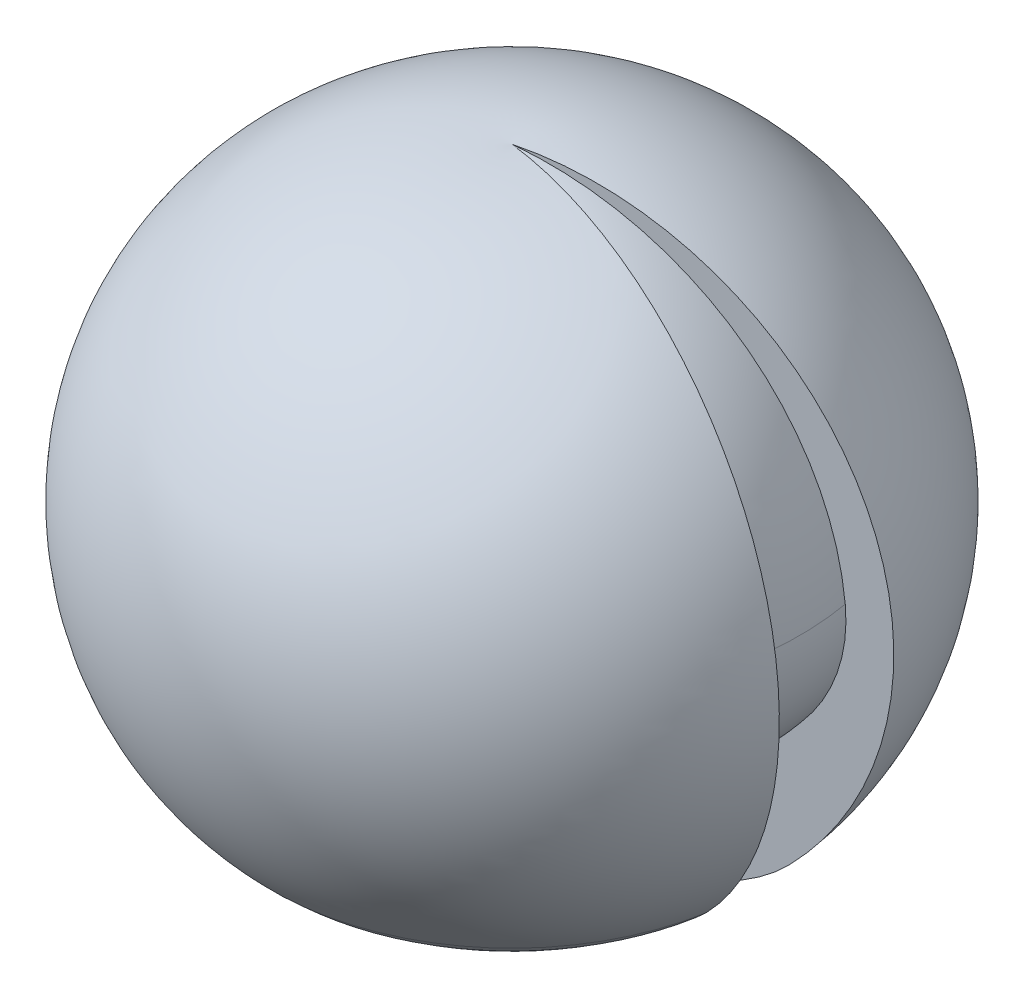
ISO-10303-21;
HEADER;
FILE_DESCRIPTION(('STEP AP214'),'2;1');
FILE_NAME('part.step','',(''),(''),'','','');
FILE_SCHEMA(('AUTOMOTIVE_DESIGN { 1 0 10303 214 1 1 1 1 }'));
ENDSEC;
DATA;
#1=APPLICATION_CONTEXT('core data for automotive mechanical design processes');
#2=APPLICATION_PROTOCOL_DEFINITION('international standard','automotive_design',2000,#1);
#3=PRODUCT_CONTEXT('',#1,'mechanical');
#4=PRODUCT('Part','Part','',(#3));
#5=PRODUCT_RELATED_PRODUCT_CATEGORY('part','',(#4));
#6=PRODUCT_DEFINITION_FORMATION('','',#4);
#7=PRODUCT_DEFINITION_CONTEXT('part definition',#1,'design');
#8=PRODUCT_DEFINITION('design','',#6,#7);
#9=PRODUCT_DEFINITION_SHAPE('','',#8);
#10=(LENGTH_UNIT() NAMED_UNIT(*) SI_UNIT(.MILLI.,.METRE.));
#11=(NAMED_UNIT(*) PLANE_ANGLE_UNIT() SI_UNIT($,.RADIAN.));
#12=(NAMED_UNIT(*) SI_UNIT($,.STERADIAN.) SOLID_ANGLE_UNIT());
#13=UNCERTAINTY_MEASURE_WITH_UNIT(LENGTH_MEASURE(1.E-05),#10,'distance_accuracy_value','');
#14=(GEOMETRIC_REPRESENTATION_CONTEXT(3) GLOBAL_UNCERTAINTY_ASSIGNED_CONTEXT((#13)) GLOBAL_UNIT_ASSIGNED_CONTEXT((#10,
#11,#12)) REPRESENTATION_CONTEXT('',''));
#15=CARTESIAN_POINT('',(0.,0.,0.));
#16=DIRECTION('',(0.,0.,1.));
#17=DIRECTION('',(1.,0.,0.));
#18=AXIS2_PLACEMENT_3D('',#15,#16,#17);
#19=CARTESIAN_POINT('',(0.,365.,-49.9999999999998));
#20=DIRECTION('',(-1.,0.,0.));
#21=DIRECTION('',(0.,0.,-1.));
#22=AXIS2_PLACEMENT_3D('',#19,#20,#21);
#23=CIRCLE('',#22,759.17);
#24=TRIMMED_CURVE('',#23,(PARAMETER_VALUE(-1.63670543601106)),
(PARAMETER_VALUE(1.63670543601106)),.T.,.PARAMETER.);
#25=CARTESIAN_POINT('',(0.,365.,0.));
#26=DIRECTION('',(0.,-1.,0.));
#27=AXIS1_PLACEMENT('',#25,#26);
#28=SURFACE_OF_REVOLUTION('',#24,#27);
#29=CARTESIAN_POINT('',(0.,-171.814255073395,0.));
#30=DIRECTION('',(0.,-1.,0.));
#31=DIRECTION('',(0.,0.,-1.));
#32=AXIS2_PLACEMENT_3D('',#29,#30,#31);
#33=CIRCLE('',#32,586.814255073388);
#34=CARTESIAN_POINT('',(577.899227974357,-171.814255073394,101.899226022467));
#35=VERTEX_POINT('',#34);
#36=CARTESIAN_POINT('',(577.899227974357,-171.814255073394,-101.899226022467));
#37=VERTEX_POINT('',#36);
#38=EDGE_CURVE('E130',#35,#37,#33,.T.);
#39=ORIENTED_EDGE('',*,*,#38,.F.);
#40=CARTESIAN_POINT('',(49.2403876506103,365.,8.68240888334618));
#41=DIRECTION('',(0.173648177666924,0.,-0.984807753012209));
#42=DIRECTION('',(-0.984807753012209,0.,-0.173648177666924));
#43=AXIS2_PLACEMENT_3D('',#40,#41,#42);
#44=CIRCLE('',#43,759.17);
#45=CARTESIAN_POINT('',(0.,1122.52167553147,0.));
#46=VERTEX_POINT('',#45);
#47=EDGE_CURVE('E115',#46,#35,#44,.T.);
#48=ORIENTED_EDGE('',*,*,#47,.F.);
#49=CARTESIAN_POINT('',(49.2403876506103,365.,-8.68240888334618));
#50=DIRECTION('',(-0.173648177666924,0.,-0.984807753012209));
#51=DIRECTION('',(-0.984807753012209,0.,0.173648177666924));
#52=AXIS2_PLACEMENT_3D('',#49,#50,#51);
#53=CIRCLE('',#52,759.17);
#54=EDGE_CURVE('E123',#46,#37,#53,.T.);
#55=ORIENTED_EDGE('',*,*,#54,.T.);
#56=EDGE_LOOP('',(#39,#48,#55));
#57=FACE_BOUND('',#56,.T.);
#58=ADVANCED_FACE('F36',(#57),#28,.T.);
#59=CARTESIAN_POINT('',(0.,103.370490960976,0.));
#60=DIRECTION('',(0.,-1.,0.));
#61=DIRECTION('',(0.,0.,-1.));
#62=AXIS2_PLACEMENT_3D('',#59,#60,#61);
#63=DEGENERATE_TOROIDAL_SURFACE('',#62,311.629509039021,389.17,.T.);
#64=CARTESIAN_POINT('',(0.,-262.862988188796,0.));
#65=DIRECTION('',(0.,-1.,0.));
#66=DIRECTION('',(0.,0.,-1.));
#67=AXIS2_PLACEMENT_3D('',#64,#65,#66);
#68=CIRCLE('',#67,180.);
#69=CARTESIAN_POINT('',(177.265395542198,-262.862988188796,31.2566719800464));
#70=VERTEX_POINT('',#69);
#71=CARTESIAN_POINT('',(177.265395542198,-262.862988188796,-31.2566719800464));
#72=VERTEX_POINT('',#71);
#73=EDGE_CURVE('E151',#70,#72,#68,.T.);
#74=ORIENTED_EDGE('',*,*,#73,.F.);
#75=CARTESIAN_POINT('',(306.895156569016,103.370490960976,54.1138963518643));
#76=DIRECTION('',(0.173648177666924,0.,-0.984807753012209));
#77=DIRECTION('',(-0.984807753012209,0.,-0.173648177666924));
#78=AXIS2_PLACEMENT_3D('',#75,#76,#77);
#79=CIRCLE('',#78,389.17);
#80=EDGE_CURVE('E131',#35,#70,#79,.T.);
#81=ORIENTED_EDGE('',*,*,#80,.F.);
#82=ORIENTED_EDGE('',*,*,#38,.T.);
#83=CARTESIAN_POINT('',(306.895156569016,103.370490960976,-54.1138963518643));
#84=DIRECTION('',(-0.173648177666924,0.,-0.984807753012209));
#85=DIRECTION('',(-0.984807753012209,0.,0.173648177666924));
#86=AXIS2_PLACEMENT_3D('',#83,#84,#85);
#87=CIRCLE('',#86,389.17);
#88=EDGE_CURVE('E127',#37,#72,#87,.T.);
#89=ORIENTED_EDGE('',*,*,#88,.T.);
#90=EDGE_LOOP('',(#74,#81,#82,#89));
#91=FACE_BOUND('',#90,.T.);
#92=ADVANCED_FACE('F38',(#91),#63,.T.);
#93=CARTESIAN_POINT('',(0.,620.747964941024,0.));
#94=DIRECTION('',(0.,-1.,0.));
#95=DIRECTION('',(0.,0.,-1.));
#96=AXIS2_PLACEMENT_3D('',#93,#94,#95);
#97=CYLINDRICAL_SURFACE('',#96,180.);
#98=CARTESIAN_POINT('',(0.,196.924077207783,0.));
#99=DIRECTION('',(0.,-1.,0.));
#100=DIRECTION('',(0.,0.,-1.));
#101=AXIS2_PLACEMENT_3D('',#98,#99,#100);
#102=CIRCLE('',#101,180.);
#103=CARTESIAN_POINT('',(177.265395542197,196.924077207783,31.2566719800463));
#104=VERTEX_POINT('',#103);
#105=CARTESIAN_POINT('',(177.265395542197,196.924077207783,-31.2566719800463));
#106=VERTEX_POINT('',#105);
#107=EDGE_CURVE('E149',#104,#106,#102,.T.);
#108=ORIENTED_EDGE('',*,*,#107,.F.);
#109=DIRECTION('',(0.,1.,0.));
#110=VECTOR('',#109,1.);
#111=CARTESIAN_POINT('',(177.265395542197,196.924077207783,31.2566719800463));
#112=LINE('',#111,#110);
#113=EDGE_CURVE('E134',#70,#104,#112,.T.);
#114=ORIENTED_EDGE('',*,*,#113,.F.);
#115=ORIENTED_EDGE('',*,*,#73,.T.);
#116=DIRECTION('',(0.,1.,0.));
#117=VECTOR('',#116,1.);
#118=CARTESIAN_POINT('',(177.265395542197,196.924077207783,-31.2566719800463));
#119=LINE('',#118,#117);
#120=EDGE_CURVE('E173',#72,#106,#119,.T.);
#121=ORIENTED_EDGE('',*,*,#120,.T.);
#122=EDGE_LOOP('',(#108,#114,#115,#121));
#123=FACE_BOUND('',#122,.T.);
#124=ADVANCED_FACE('F184',(#123),#97,.F.);
#125=CARTESIAN_POINT('',(0.,365.,0.));
#126=DIRECTION('',(0.,-1.,0.));
#127=DIRECTION('',(0.,0.,-1.));
#128=AXIS2_PLACEMENT_3D('',#125,#126,#127);
#129=DEGENERATE_TOROIDAL_SURFACE('',#128,49.9999999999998,212.484154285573,.T.);
#130=CARTESIAN_POINT('',(0.,576.233107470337,0.));
#131=DIRECTION('',(0.,-1.,0.));
#132=DIRECTION('',(0.,0.,-1.));
#133=AXIS2_PLACEMENT_3D('',#130,#131,#132);
#134=CIRCLE('',#133,26.976313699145);
#135=CARTESIAN_POINT('',(26.5664828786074,576.233107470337,4.68438771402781));
#136=VERTEX_POINT('',#135);
#137=CARTESIAN_POINT('',(26.5664828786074,576.233107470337,-4.68438771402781));
#138=VERTEX_POINT('',#137);
#139=EDGE_CURVE('E59',#136,#138,#134,.T.);
#140=ORIENTED_EDGE('',*,*,#139,.F.);
#141=CARTESIAN_POINT('',(49.2403876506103,365.,8.68240888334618));
#142=DIRECTION('',(-0.173648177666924,0.,0.984807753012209));
#143=DIRECTION('',(-0.984807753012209,0.,-0.173648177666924));
#144=AXIS2_PLACEMENT_3D('',#141,#142,#143);
#145=CIRCLE('',#144,212.484154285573);
#146=EDGE_CURVE('E143',#104,#136,#145,.T.);
#147=ORIENTED_EDGE('',*,*,#146,.F.);
#148=ORIENTED_EDGE('',*,*,#107,.T.);
#149=CARTESIAN_POINT('',(49.2403876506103,365.,-8.68240888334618));
#150=DIRECTION('',(0.173648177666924,0.,0.984807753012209));
#151=DIRECTION('',(-0.984807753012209,0.,0.173648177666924));
#152=AXIS2_PLACEMENT_3D('',#149,#150,#151);
#153=CIRCLE('',#152,212.484154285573);
#154=EDGE_CURVE('E137',#106,#138,#153,.T.);
#155=ORIENTED_EDGE('',*,*,#154,.T.);
#156=EDGE_LOOP('',(#140,#147,#148,#155));
#157=FACE_BOUND('',#156,.T.);
#158=ADVANCED_FACE('F177',(#157),#129,.F.);
#159=CARTESIAN_POINT('',(0.,397.247624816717,318.592038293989));
#160=DIRECTION('',(-1.,0.,0.));
#161=DIRECTION('',(0.,0.,-1.));
#162=AXIS2_PLACEMENT_3D('',#159,#160,#161);
#163=CIRCLE('',#162,389.169999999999);
#164=TRIMMED_CURVE('',#163,(PARAMETER_VALUE(-0.611748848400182)),
(PARAMETER_VALUE(0.611748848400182)),.T.,.PARAMETER.);
#165=CARTESIAN_POINT('',(0.,397.247624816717,0.));
#166=DIRECTION('',(0.,-1.,0.));
#167=AXIS1_PLACEMENT('',#165,#166);
#168=SURFACE_OF_REVOLUTION('',#164,#167);
#169=CARTESIAN_POINT('',(-313.751909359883,397.247624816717,55.322926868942));
#170=DIRECTION('',(0.173648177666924,0.,0.984807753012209));
#171=DIRECTION('',(-0.984807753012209,0.,0.173648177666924));
#172=AXIS2_PLACEMENT_3D('',#169,#170,#171);
#173=CIRCLE('',#172,389.169999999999);
#174=CARTESIAN_POINT('',(1.45416380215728E-11,620.747964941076,2.56408312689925E-12));
#175=VERTEX_POINT('',#174);
#176=EDGE_CURVE('E132',#138,#175,#173,.T.);
#177=ORIENTED_EDGE('',*,*,#176,.T.);
#178=CARTESIAN_POINT('',(-313.751909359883,397.247624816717,-55.322926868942));
#179=DIRECTION('',(-0.173648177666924,0.,0.984807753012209));
#180=DIRECTION('',(-0.984807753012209,0.,-0.173648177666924));
#181=AXIS2_PLACEMENT_3D('',#178,#179,#180);
#182=CIRCLE('',#181,389.169999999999);
#183=EDGE_CURVE('E145',#136,#175,#182,.T.);
#184=ORIENTED_EDGE('',*,*,#183,.F.);
#185=ORIENTED_EDGE('',*,*,#139,.T.);
#186=EDGE_LOOP('',(#177,#184,#185));
#187=FACE_BOUND('',#186,.T.);
#188=ADVANCED_FACE('F180',(#187),#168,.F.);
#189=CARTESIAN_POINT('',(49.2403876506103,365.,8.68240888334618));
#190=DIRECTION('',(0.173648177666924,0.,-0.984807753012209));
#191=DIRECTION('',(-0.984807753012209,0.,-0.173648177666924));
#192=AXIS2_PLACEMENT_3D('',#189,#190,#191);
#193=PLANE('',#192);
#194=CARTESIAN_POINT('',(-49.2403876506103,365.,-8.68240888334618));
#195=DIRECTION('',(0.173648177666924,0.,-0.984807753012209));
#196=DIRECTION('',(-0.984807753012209,0.,-0.173648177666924));
#197=AXIS2_PLACEMENT_3D('',#194,#195,#196);
#198=CIRCLE('',#197,759.17);
#199=CARTESIAN_POINT('',(695.551131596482,431.166025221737,122.644430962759));
#200=VERTEX_POINT('',#199);
#201=EDGE_CURVE('E103',#46,#200,#198,.T.);
#202=ORIENTED_EDGE('',*,*,#201,.F.);
#203=ORIENTED_EDGE('',*,*,#47,.T.);
#204=ORIENTED_EDGE('',*,*,#80,.T.);
#205=ORIENTED_EDGE('',*,*,#113,.T.);
#206=ORIENTED_EDGE('',*,*,#146,.T.);
#207=ORIENTED_EDGE('',*,*,#183,.T.);
#208=CARTESIAN_POINT('',(313.751909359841,397.247624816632,55.3229268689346));
#209=DIRECTION('',(0.173648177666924,0.,-0.984807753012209));
#210=DIRECTION('',(-0.984807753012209,0.,-0.173648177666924));
#211=AXIS2_PLACEMENT_3D('',#208,#209,#210);
#212=CIRCLE('',#211,389.170000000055);
#213=CARTESIAN_POINT('',(231.572627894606,777.365872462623,40.8325022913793));
#214=VERTEX_POINT('',#213);
#215=EDGE_CURVE('E119',#214,#175,#212,.F.);
#216=ORIENTED_EDGE('',*,*,#215,.F.);
#217=CARTESIAN_POINT('',(-49.2403876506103,365.,-8.68240888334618));
#218=DIRECTION('',(0.173648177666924,0.,-0.984807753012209));
#219=DIRECTION('',(-0.984807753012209,0.,-0.173648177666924));
#220=AXIS2_PLACEMENT_3D('',#217,#218,#219);
#221=CIRCLE('',#220,501.351462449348);
#222=CARTESIAN_POINT('',(297.825164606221,8.41380289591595,52.5146120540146));
#223=VERTEX_POINT('',#222);
#224=EDGE_CURVE('E168',#223,#214,#221,.F.);
#225=ORIENTED_EDGE('',*,*,#224,.F.);
#226=CARTESIAN_POINT('',(313.751909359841,397.247624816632,55.3229268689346));
#227=DIRECTION('',(0.173648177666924,0.,-0.984807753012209));
#228=DIRECTION('',(-0.984807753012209,0.,-0.173648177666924));
#229=AXIS2_PLACEMENT_3D('',#226,#227,#228);
#230=CIRCLE('',#229,389.17);
#231=EDGE_CURVE('E118',#200,#223,#230,.T.);
#232=ORIENTED_EDGE('',*,*,#231,.F.);
#233=EDGE_LOOP('',(#202,#203,#204,#205,#206,#207,#216,#225,#232));
#234=FACE_BOUND('',#233,.T.);
#235=ADVANCED_FACE('F112',(#234),#193,.T.);
#236=CARTESIAN_POINT('',(49.2403876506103,365.,-8.68240888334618));
#237=DIRECTION('',(-0.173648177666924,0.,-0.984807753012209));
#238=DIRECTION('',(-0.984807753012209,0.,0.173648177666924));
#239=AXIS2_PLACEMENT_3D('',#236,#237,#238);
#240=PLANE('',#239);
#241=ORIENTED_EDGE('',*,*,#54,.F.);
#242=CARTESIAN_POINT('',(-49.2403876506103,365.,8.68240888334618));
#243=DIRECTION('',(-0.173648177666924,0.,-0.984807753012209));
#244=DIRECTION('',(-0.984807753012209,0.,0.173648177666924));
#245=AXIS2_PLACEMENT_3D('',#242,#243,#244);
#246=CIRCLE('',#245,759.17);
#247=CARTESIAN_POINT('',(695.551131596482,431.166025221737,-122.644430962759));
#248=VERTEX_POINT('',#247);
#249=EDGE_CURVE('E11',#46,#248,#246,.T.);
#250=ORIENTED_EDGE('',*,*,#249,.T.);
#251=CARTESIAN_POINT('',(313.751909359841,397.247624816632,-55.3229268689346));
#252=DIRECTION('',(-0.173648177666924,0.,-0.984807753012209));
#253=DIRECTION('',(-0.984807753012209,0.,0.173648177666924));
#254=AXIS2_PLACEMENT_3D('',#251,#252,#253);
#255=CIRCLE('',#254,389.17);
#256=CARTESIAN_POINT('',(297.825164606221,8.41380289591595,-52.5146120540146));
#257=VERTEX_POINT('',#256);
#258=EDGE_CURVE('E44',#248,#257,#255,.T.);
#259=ORIENTED_EDGE('',*,*,#258,.T.);
#260=CARTESIAN_POINT('',(-49.2403876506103,365.,8.68240888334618));
#261=DIRECTION('',(-0.173648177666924,0.,-0.984807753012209));
#262=DIRECTION('',(-0.984807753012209,0.,0.173648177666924));
#263=AXIS2_PLACEMENT_3D('',#260,#261,#262);
#264=CIRCLE('',#263,501.351462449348);
#265=CARTESIAN_POINT('',(231.572627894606,777.365872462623,-40.8325022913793));
#266=VERTEX_POINT('',#265);
#267=EDGE_CURVE('E154',#257,#266,#264,.F.);
#268=ORIENTED_EDGE('',*,*,#267,.T.);
#269=CARTESIAN_POINT('',(313.751909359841,397.247624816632,-55.3229268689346));
#270=DIRECTION('',(-0.173648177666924,0.,-0.984807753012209));
#271=DIRECTION('',(-0.984807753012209,0.,0.173648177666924));
#272=AXIS2_PLACEMENT_3D('',#269,#270,#271);
#273=CIRCLE('',#272,389.170000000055);
#274=EDGE_CURVE('E157',#266,#175,#273,.F.);
#275=ORIENTED_EDGE('',*,*,#274,.T.);
#276=ORIENTED_EDGE('',*,*,#176,.F.);
#277=ORIENTED_EDGE('',*,*,#154,.F.);
#278=ORIENTED_EDGE('',*,*,#120,.F.);
#279=ORIENTED_EDGE('',*,*,#88,.F.);
#280=EDGE_LOOP('',(#241,#250,#259,#268,#275,#276,#277,#278,#279));
#281=FACE_BOUND('',#280,.T.);
#282=ADVANCED_FACE('F124',(#281),#240,.F.);
#283=CARTESIAN_POINT('',(0.,397.247624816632,0.));
#284=DIRECTION('',(0.,-1.,0.));
#285=DIRECTION('',(0.,0.,-1.));
#286=AXIS2_PLACEMENT_3D('',#283,#284,#285);
#287=DEGENERATE_TOROIDAL_SURFACE('',#286,318.592038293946,389.17,.T.);
#288=CARTESIAN_POINT('',(0.,431.166025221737,0.));
#289=DIRECTION('',(0.,-1.,0.));
#290=DIRECTION('',(0.,0.,-1.));
#291=AXIS2_PLACEMENT_3D('',#288,#289,#290);
#292=CIRCLE('',#291,706.281128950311);
#293=EDGE_CURVE('E105',#248,#200,#292,.T.);
#294=ORIENTED_EDGE('',*,*,#293,.T.);
#295=ORIENTED_EDGE('',*,*,#231,.T.);
#296=CARTESIAN_POINT('',(0.,8.41380289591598,0.));
#297=DIRECTION('',(0.,-1.,0.));
#298=DIRECTION('',(0.,0.,-1.));
#299=AXIS2_PLACEMENT_3D('',#296,#297,#298);
#300=CIRCLE('',#299,302.419597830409);
#301=EDGE_CURVE('E163',#257,#223,#300,.T.);
#302=ORIENTED_EDGE('',*,*,#301,.F.);
#303=ORIENTED_EDGE('',*,*,#258,.F.);
#304=EDGE_LOOP('',(#294,#295,#302,#303));
#305=FACE_BOUND('',#304,.T.);
#306=ADVANCED_FACE('F161',(#305),#287,.T.);
#307=CARTESIAN_POINT('',(0.,365.,49.9999999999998));
#308=DIRECTION('',(-1.,0.,0.));
#309=DIRECTION('',(0.,0.,-1.));
#310=AXIS2_PLACEMENT_3D('',#307,#308,#309);
#311=CIRCLE('',#310,759.17);
#312=TRIMMED_CURVE('',#311,(PARAMETER_VALUE(-1.50488721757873)),
(PARAMETER_VALUE(1.50488721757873)),.T.,.PARAMETER.);
#313=CARTESIAN_POINT('',(0.,365.,0.));
#314=DIRECTION('',(0.,-1.,0.));
#315=AXIS1_PLACEMENT('',#313,#314);
#316=SURFACE_OF_REVOLUTION('',#312,#315);
#317=ORIENTED_EDGE('',*,*,#249,.F.);
#318=ORIENTED_EDGE('',*,*,#201,.T.);
#319=ORIENTED_EDGE('',*,*,#293,.F.);
#320=EDGE_LOOP('',(#317,#318,#319));
#321=FACE_BOUND('',#320,.T.);
#322=ADVANCED_FACE('F102',(#321),#316,.T.);
#323=CARTESIAN_POINT('',(0.,397.247624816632,-318.592038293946));
#324=DIRECTION('',(-1.,0.,0.));
#325=DIRECTION('',(0.,0.,-1.));
#326=AXIS2_PLACEMENT_3D('',#323,#324,#325);
#327=CIRCLE('',#326,389.170000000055);
#328=TRIMMED_CURVE('',#327,(PARAMETER_VALUE(-2.52984380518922)),
(PARAMETER_VALUE(2.52984380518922)),.T.,.PARAMETER.);
#329=CARTESIAN_POINT('',(0.,397.247624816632,0.));
#330=DIRECTION('',(0.,-1.,0.));
#331=AXIS1_PLACEMENT('',#329,#330);
#332=SURFACE_OF_REVOLUTION('',#328,#331);
#333=CARTESIAN_POINT('',(0.,777.365872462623,0.));
#334=DIRECTION('',(0.,-1.,0.));
#335=DIRECTION('',(0.,0.,-1.));
#336=AXIS2_PLACEMENT_3D('',#333,#334,#335);
#337=CIRCLE('',#336,235.145008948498);
#338=EDGE_CURVE('E51',#266,#214,#337,.T.);
#339=ORIENTED_EDGE('',*,*,#338,.T.);
#340=ORIENTED_EDGE('',*,*,#215,.T.);
#341=ORIENTED_EDGE('',*,*,#274,.F.);
#342=EDGE_LOOP('',(#339,#340,#341));
#343=FACE_BOUND('',#342,.T.);
#344=ADVANCED_FACE('F230',(#343),#332,.F.);
#345=CARTESIAN_POINT('',(0.,365.,0.));
#346=DIRECTION('',(0.,-1.,0.));
#347=DIRECTION('',(0.,0.,-1.));
#348=AXIS2_PLACEMENT_3D('',#345,#346,#347);
#349=DEGENERATE_TOROIDAL_SURFACE('',#348,49.9999999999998,501.351462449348,.F.);
#350=ORIENTED_EDGE('',*,*,#301,.T.);
#351=ORIENTED_EDGE('',*,*,#224,.T.);
#352=ORIENTED_EDGE('',*,*,#338,.F.);
#353=ORIENTED_EDGE('',*,*,#267,.F.);
#354=EDGE_LOOP('',(#350,#351,#352,#353));
#355=FACE_BOUND('',#354,.T.);
#356=ADVANCED_FACE('F237',(#355),#349,.T.);
#357=CLOSED_SHELL('',(#58,#92,#124,#158,#188,#235,#282,#306,#322,#344,#356));
#358=MANIFOLD_SOLID_BREP('B2',#357);
#359=ADVANCED_BREP_SHAPE_REPRESENTATION('',(#18,#358),#14);
#360=SHAPE_DEFINITION_REPRESENTATION(#9,#359);
ENDSEC;
END-ISO-10303-21;
